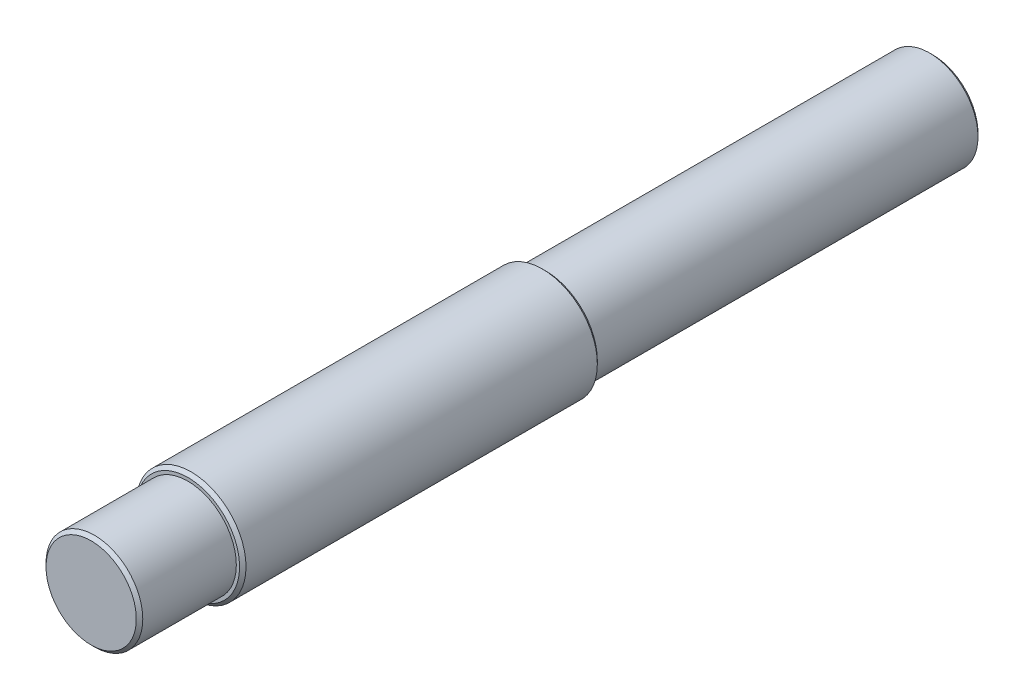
from build123d import *

# Parameters (mm, degrees)
CHAMFER_1_SIZE = 0.1


with BuildPart() as part:
    # Sketch 1 → Revolve 1 (revolve)
    with BuildSketch(Plane(origin=(0, 0, 0), x_dir=(0, 0, -1), z_dir=(1, 0, 0)), mode=Mode.PRIVATE) as revolve_1_sk:
        Polygon((-13.045, 0), (13.045, 0), (13.045, 1.5), (1.045, 1.5), (1.045, 1.7), (-10.045, 1.7), (-10.045, 1.5), (-13.045, 1.5), align=None)
    revolve(revolve_1_sk.sketch.rotate(Axis((0, 0, 13.045), (0, 0, -1)), 90), axis=Axis((0, 0, 13.045), (0, 0, -1)))

    # Chamfer 1
    chamfer_1_edges = [part.edges().sort_by_distance(p)[0] for p in [
        (-1.5, 0, -13.045),
        (-1.7, 0, -1.045),
        (-1.7, 0, 10.045),
        (-1.5, 0, 13.045),
    ]]
    chamfer(chamfer_1_edges, length=CHAMFER_1_SIZE)


solid = part.part
